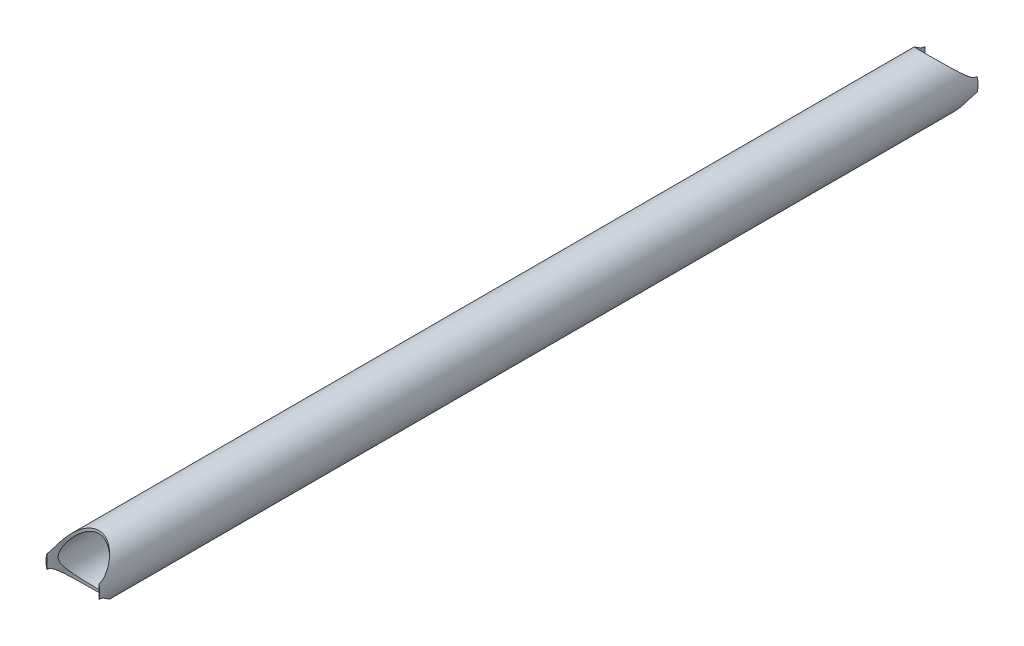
from build123d import *

# Parameters (mm, degrees)
ESQUISSE2_R           = 15
ESQUISSE2_R_2         = 13.5
EXTRUSION1_DEPTH      = 490
EXTRUSION2_DEPTH      = 491.458968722
EXTRUSION2_DEPTH_BACK = 491.458968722
ESQUISSE3_R           = 14.5


with BuildPart() as part:
    # Esquisse2 → Extrusion1 (new body)
    with BuildSketch(Plane.XY):
        Circle(ESQUISSE2_R)
        Circle(ESQUISSE2_R_2, mode=Mode.SUBTRACT)
    extrude(amount=EXTRUSION1_DEPTH)

    # Esquisse3 → Extrusion2 (cut, two sides: drawn at the far end of the back side and taken through both)
    with BuildSketch(Plane(origin=(0, 0, 0), x_dir=(-1, 0, 0), z_dir=(0, 1, 0)).offset(-EXTRUSION2_DEPTH_BACK)):
        with Locations((0, 490)):
            Circle(ESQUISSE3_R)
        Circle(ESQUISSE3_R)
    extrude(amount=EXTRUSION2_DEPTH + EXTRUSION2_DEPTH_BACK, mode=Mode.SUBTRACT)


solid = part.part
